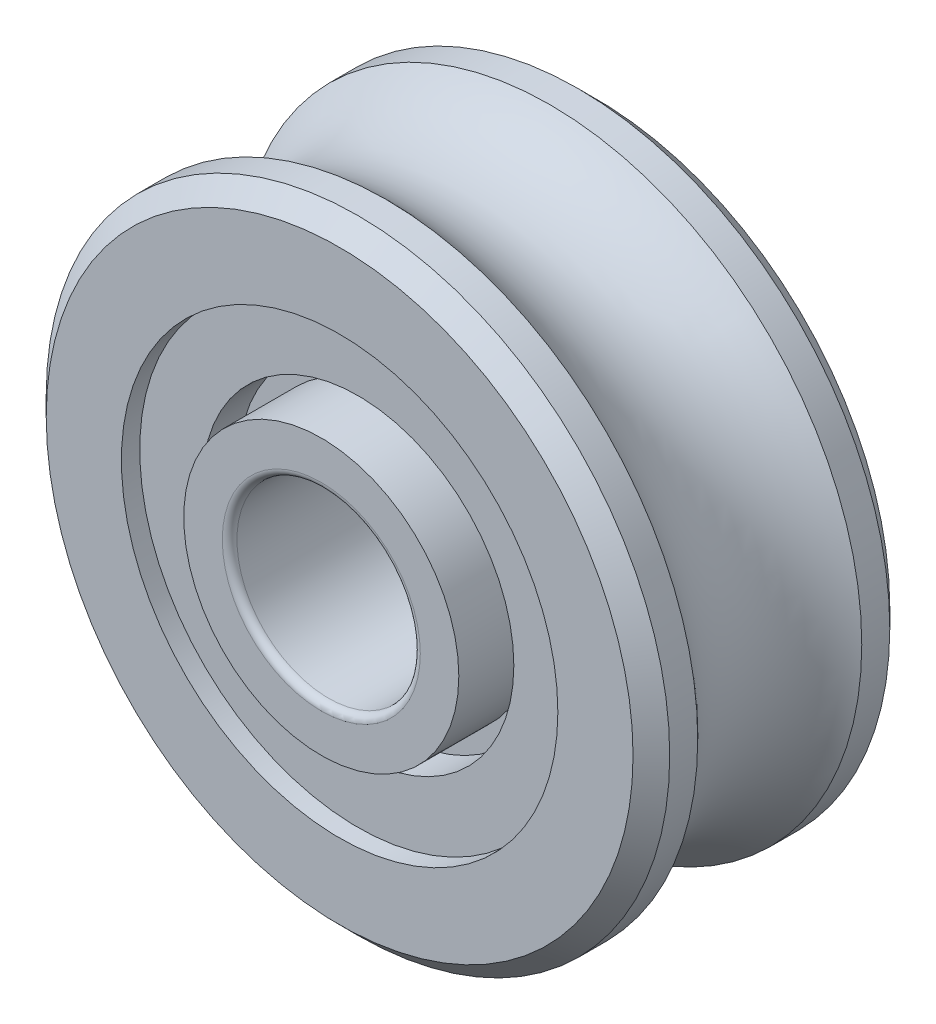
ISO-10303-21;
HEADER;
FILE_DESCRIPTION(('STEP AP214'),'2;1');
FILE_NAME('part.step','',(''),(''),'','','');
FILE_SCHEMA(('AUTOMOTIVE_DESIGN { 1 0 10303 214 1 1 1 1 }'));
ENDSEC;
DATA;
#1=APPLICATION_CONTEXT('core data for automotive mechanical design processes');
#2=APPLICATION_PROTOCOL_DEFINITION('international standard','automotive_design',2000,#1);
#3=PRODUCT_CONTEXT('',#1,'mechanical');
#4=PRODUCT('Part','Part','',(#3));
#5=PRODUCT_RELATED_PRODUCT_CATEGORY('part','',(#4));
#6=PRODUCT_DEFINITION_FORMATION('','',#4);
#7=PRODUCT_DEFINITION_CONTEXT('part definition',#1,'design');
#8=PRODUCT_DEFINITION('design','',#6,#7);
#9=PRODUCT_DEFINITION_SHAPE('','',#8);
#10=(LENGTH_UNIT() NAMED_UNIT(*) SI_UNIT(.MILLI.,.METRE.));
#11=(NAMED_UNIT(*) PLANE_ANGLE_UNIT() SI_UNIT($,.RADIAN.));
#12=(NAMED_UNIT(*) SI_UNIT($,.STERADIAN.) SOLID_ANGLE_UNIT());
#13=UNCERTAINTY_MEASURE_WITH_UNIT(LENGTH_MEASURE(1.E-05),#10,'distance_accuracy_value','');
#14=(GEOMETRIC_REPRESENTATION_CONTEXT(3) GLOBAL_UNCERTAINTY_ASSIGNED_CONTEXT((#13)) GLOBAL_UNIT_ASSIGNED_CONTEXT((#10,
#11,#12)) REPRESENTATION_CONTEXT('',''));
#15=CARTESIAN_POINT('',(0.,0.,0.));
#16=DIRECTION('',(0.,0.,1.));
#17=DIRECTION('',(1.,0.,0.));
#18=AXIS2_PLACEMENT_3D('',#15,#16,#17);
#19=CARTESIAN_POINT('',(0.,3.75,2.));
#20=DIRECTION('',(0.,0.,-1.));
#21=DIRECTION('',(-1.,0.,0.));
#22=AXIS2_PLACEMENT_3D('',#19,#20,#21);
#23=PLANE('',#22);
#24=CARTESIAN_POINT('',(0.,0.,2.));
#25=DIRECTION('',(0.,0.,1.));
#26=DIRECTION('',(1.,0.,0.));
#27=AXIS2_PLACEMENT_3D('',#24,#25,#26);
#28=CIRCLE('',#27,4.25);
#29=CARTESIAN_POINT('',(4.25,0.,2.));
#30=VERTEX_POINT('',#29);
#31=EDGE_CURVE('E200',#30,#30,#28,.T.);
#32=ORIENTED_EDGE('',*,*,#31,.T.);
#33=EDGE_LOOP('',(#32));
#34=FACE_BOUND('',#33,.T.);
#35=CARTESIAN_POINT('',(0.,0.,2.));
#36=DIRECTION('',(0.,0.,1.));
#37=DIRECTION('',(1.,0.,0.));
#38=AXIS2_PLACEMENT_3D('',#35,#36,#37);
#39=CIRCLE('',#38,3.75);
#40=CARTESIAN_POINT('',(3.75,0.,2.));
#41=VERTEX_POINT('',#40);
#42=EDGE_CURVE('E197',#41,#41,#39,.T.);
#43=ORIENTED_EDGE('',*,*,#42,.F.);
#44=EDGE_LOOP('',(#43));
#45=FACE_BOUND('',#44,.T.);
#46=ADVANCED_FACE('F14',(#34,#45),#23,.F.);
#47=CARTESIAN_POINT('',(0.,0.,38.6779652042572));
#48=DIRECTION('',(0.,0.,1.));
#49=DIRECTION('',(1.,0.,0.));
#50=AXIS2_PLACEMENT_3D('',#47,#48,#49);
#51=CYLINDRICAL_SURFACE('',#50,3.75);
#52=CARTESIAN_POINT('',(0.,0.,4.));
#53=DIRECTION('',(0.,0.,1.));
#54=DIRECTION('',(1.,0.,0.));
#55=AXIS2_PLACEMENT_3D('',#52,#53,#54);
#56=CIRCLE('',#55,3.75);
#57=CARTESIAN_POINT('',(3.75,0.,4.));
#58=VERTEX_POINT('',#57);
#59=EDGE_CURVE('E203',#58,#58,#56,.F.);
#60=ORIENTED_EDGE('',*,*,#59,.T.);
#61=EDGE_LOOP('',(#60));
#62=FACE_BOUND('',#61,.T.);
#63=ORIENTED_EDGE('',*,*,#42,.T.);
#64=EDGE_LOOP('',(#63));
#65=FACE_BOUND('',#64,.T.);
#66=ADVANCED_FACE('F83',(#62,#65),#51,.T.);
#67=CARTESIAN_POINT('',(0.,0.,38.6779652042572));
#68=DIRECTION('',(0.,0.,1.));
#69=DIRECTION('',(1.,0.,0.));
#70=AXIS2_PLACEMENT_3D('',#67,#68,#69);
#71=CYLINDRICAL_SURFACE('',#70,4.25);
#72=ORIENTED_EDGE('',*,*,#31,.F.);
#73=EDGE_LOOP('',(#72));
#74=FACE_BOUND('',#73,.T.);
#75=CARTESIAN_POINT('',(0.,0.,3.));
#76=DIRECTION('',(0.,0.,1.));
#77=DIRECTION('',(1.,0.,0.));
#78=AXIS2_PLACEMENT_3D('',#75,#76,#77);
#79=CIRCLE('',#78,4.25);
#80=CARTESIAN_POINT('',(4.25,0.,3.));
#81=VERTEX_POINT('',#80);
#82=EDGE_CURVE('E54',#81,#81,#79,.T.);
#83=ORIENTED_EDGE('',*,*,#82,.T.);
#84=EDGE_LOOP('',(#83));
#85=FACE_BOUND('',#84,.T.);
#86=ADVANCED_FACE('F72',(#74,#85),#71,.F.);
#87=CARTESIAN_POINT('',(0.,3.75,4.));
#88=DIRECTION('',(0.,0.,-1.));
#89=DIRECTION('',(-1.,0.,0.));
#90=AXIS2_PLACEMENT_3D('',#87,#88,#89);
#91=PLANE('',#90);
#92=ORIENTED_EDGE('',*,*,#59,.F.);
#93=EDGE_LOOP('',(#92));
#94=FACE_BOUND('',#93,.T.);
#95=CARTESIAN_POINT('',(0.,0.,4.));
#96=DIRECTION('',(0.,0.,1.));
#97=DIRECTION('',(-1.,0.,0.));
#98=AXIS2_PLACEMENT_3D('',#95,#96,#97);
#99=CIRCLE('',#98,2.7);
#100=CARTESIAN_POINT('',(-2.7,0.,4.));
#101=VERTEX_POINT('',#100);
#102=CARTESIAN_POINT('',(2.7,0.,4.));
#103=VERTEX_POINT('',#102);
#104=EDGE_CURVE('E42',#101,#103,#99,.T.);
#105=ORIENTED_EDGE('',*,*,#104,.F.);
#106=CARTESIAN_POINT('',(0.,0.,4.));
#107=DIRECTION('',(0.,0.,1.));
#108=DIRECTION('',(1.,0.,0.));
#109=AXIS2_PLACEMENT_3D('',#106,#107,#108);
#110=CIRCLE('',#109,2.7);
#111=EDGE_CURVE('E44',#103,#101,#110,.T.);
#112=ORIENTED_EDGE('',*,*,#111,.F.);
#113=EDGE_LOOP('',(#105,#112));
#114=FACE_BOUND('',#113,.T.);
#115=ADVANCED_FACE('F53',(#94,#114),#91,.F.);
#116=CARTESIAN_POINT('',(0.,5.95,3.));
#117=DIRECTION('',(0.,0.,-1.));
#118=DIRECTION('',(-1.,0.,0.));
#119=AXIS2_PLACEMENT_3D('',#116,#117,#118);
#120=PLANE('',#119);
#121=CARTESIAN_POINT('',(0.,0.,3.));
#122=DIRECTION('',(0.,0.,1.));
#123=DIRECTION('',(1.,0.,0.));
#124=AXIS2_PLACEMENT_3D('',#121,#122,#123);
#125=CIRCLE('',#124,5.95);
#126=CARTESIAN_POINT('',(5.95,0.,3.));
#127=VERTEX_POINT('',#126);
#128=EDGE_CURVE('E49',#127,#127,#125,.T.);
#129=ORIENTED_EDGE('',*,*,#128,.T.);
#130=EDGE_LOOP('',(#129));
#131=FACE_BOUND('',#130,.T.);
#132=ORIENTED_EDGE('',*,*,#82,.F.);
#133=EDGE_LOOP('',(#132));
#134=FACE_BOUND('',#133,.T.);
#135=ADVANCED_FACE('F71',(#131,#134),#120,.F.);
#136=CARTESIAN_POINT('',(0.,0.,3.8));
#137=DIRECTION('',(0.,0.,1.));
#138=DIRECTION('',(1.,0.,0.));
#139=AXIS2_PLACEMENT_3D('',#136,#137,#138);
#140=TOROIDAL_SURFACE('',#139,2.7,0.2);
#141=CARTESIAN_POINT('',(0.,0.,3.8));
#142=DIRECTION('',(0.,0.,1.));
#143=DIRECTION('',(1.,0.,0.));
#144=AXIS2_PLACEMENT_3D('',#141,#142,#143);
#145=CIRCLE('',#144,2.5);
#146=CARTESIAN_POINT('',(2.5,0.,3.8));
#147=VERTEX_POINT('',#146);
#148=EDGE_CURVE('E209',#147,#147,#145,.F.);
#149=ORIENTED_EDGE('',*,*,#148,.T.);
#150=EDGE_LOOP('',(#149));
#151=FACE_BOUND('',#150,.T.);
#152=ORIENTED_EDGE('',*,*,#111,.T.);
#153=ORIENTED_EDGE('',*,*,#104,.T.);
#154=EDGE_LOOP('',(#152,#153));
#155=FACE_BOUND('',#154,.T.);
#156=ADVANCED_FACE('F46',(#151,#155),#140,.T.);
#157=CARTESIAN_POINT('',(0.,0.,38.6779652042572));
#158=DIRECTION('',(0.,0.,1.));
#159=DIRECTION('',(1.,0.,0.));
#160=AXIS2_PLACEMENT_3D('',#157,#158,#159);
#161=CYLINDRICAL_SURFACE('',#160,5.95);
#162=ORIENTED_EDGE('',*,*,#128,.F.);
#163=EDGE_LOOP('',(#162));
#164=FACE_BOUND('',#163,.T.);
#165=CARTESIAN_POINT('',(0.,0.,3.5));
#166=DIRECTION('',(0.,0.,1.));
#167=DIRECTION('',(1.,0.,0.));
#168=AXIS2_PLACEMENT_3D('',#165,#166,#167);
#169=CIRCLE('',#168,5.95);
#170=CARTESIAN_POINT('',(5.95,0.,3.5));
#171=VERTEX_POINT('',#170);
#172=EDGE_CURVE('E210',#171,#171,#169,.T.);
#173=ORIENTED_EDGE('',*,*,#172,.T.);
#174=EDGE_LOOP('',(#173));
#175=FACE_BOUND('',#174,.T.);
#176=ADVANCED_FACE('F242',(#164,#175),#161,.F.);
#177=CARTESIAN_POINT('',(0.,0.,38.6779652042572));
#178=DIRECTION('',(0.,0.,1.));
#179=DIRECTION('',(1.,0.,0.));
#180=AXIS2_PLACEMENT_3D('',#177,#178,#179);
#181=CYLINDRICAL_SURFACE('',#180,2.5);
#182=CARTESIAN_POINT('',(0.,0.,-3.8));
#183=DIRECTION('',(0.,0.,1.));
#184=DIRECTION('',(1.,0.,0.));
#185=AXIS2_PLACEMENT_3D('',#182,#183,#184);
#186=CIRCLE('',#185,2.5);
#187=CARTESIAN_POINT('',(2.5,0.,-3.8));
#188=VERTEX_POINT('',#187);
#189=EDGE_CURVE('E213',#188,#188,#186,.T.);
#190=ORIENTED_EDGE('',*,*,#189,.F.);
#191=EDGE_LOOP('',(#190));
#192=FACE_BOUND('',#191,.T.);
#193=ORIENTED_EDGE('',*,*,#148,.F.);
#194=EDGE_LOOP('',(#193));
#195=FACE_BOUND('',#194,.T.);
#196=ADVANCED_FACE('F246',(#192,#195),#181,.F.);
#197=CARTESIAN_POINT('',(0.,8.,3.5));
#198=DIRECTION('',(0.,0.,-1.));
#199=DIRECTION('',(-1.,0.,0.));
#200=AXIS2_PLACEMENT_3D('',#197,#198,#199);
#201=PLANE('',#200);
#202=CARTESIAN_POINT('',(0.,0.,3.5));
#203=DIRECTION('',(0.,0.,-1.));
#204=DIRECTION('',(-1.,0.,0.));
#205=AXIS2_PLACEMENT_3D('',#202,#203,#204);
#206=CIRCLE('',#205,8.);
#207=CARTESIAN_POINT('',(-8.,0.,3.5));
#208=VERTEX_POINT('',#207);
#209=EDGE_CURVE('E214',#208,#208,#206,.T.);
#210=ORIENTED_EDGE('',*,*,#209,.F.);
#211=EDGE_LOOP('',(#210));
#212=FACE_BOUND('',#211,.T.);
#213=ORIENTED_EDGE('',*,*,#172,.F.);
#214=EDGE_LOOP('',(#213));
#215=FACE_BOUND('',#214,.T.);
#216=ADVANCED_FACE('F180',(#212,#215),#201,.F.);
#217=CARTESIAN_POINT('',(0.,0.,-3.8));
#218=DIRECTION('',(0.,0.,1.));
#219=DIRECTION('',(1.,0.,0.));
#220=AXIS2_PLACEMENT_3D('',#217,#218,#219);
#221=TOROIDAL_SURFACE('',#220,2.7,0.2);
#222=CARTESIAN_POINT('',(0.,0.,-4.));
#223=DIRECTION('',(0.,0.,-1.));
#224=DIRECTION('',(1.,0.,0.));
#225=AXIS2_PLACEMENT_3D('',#222,#223,#224);
#226=CIRCLE('',#225,2.7);
#227=CARTESIAN_POINT('',(2.7,0.,-4.));
#228=VERTEX_POINT('',#227);
#229=CARTESIAN_POINT('',(-2.7,0.,-4.));
#230=VERTEX_POINT('',#229);
#231=EDGE_CURVE('E143',#228,#230,#226,.T.);
#232=ORIENTED_EDGE('',*,*,#231,.T.);
#233=CARTESIAN_POINT('',(0.,0.,-4.));
#234=DIRECTION('',(0.,0.,-1.));
#235=DIRECTION('',(-1.,0.,0.));
#236=AXIS2_PLACEMENT_3D('',#233,#234,#235);
#237=CIRCLE('',#236,2.7);
#238=EDGE_CURVE('E33',#230,#228,#237,.T.);
#239=ORIENTED_EDGE('',*,*,#238,.T.);
#240=EDGE_LOOP('',(#232,#239));
#241=FACE_BOUND('',#240,.T.);
#242=ORIENTED_EDGE('',*,*,#189,.T.);
#243=EDGE_LOOP('',(#242));
#244=FACE_BOUND('',#243,.T.);
#245=ADVANCED_FACE('F176',(#241,#244),#221,.T.);
#246=CARTESIAN_POINT('',(0.,0.,3.));
#247=DIRECTION('',(0.,0.,-1.));
#248=DIRECTION('',(-1.,0.,0.));
#249=AXIS2_PLACEMENT_3D('',#246,#247,#248);
#250=CONICAL_SURFACE('',#249,8.5,0.785398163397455);
#251=CARTESIAN_POINT('',(0.,0.,3.));
#252=DIRECTION('',(0.,0.,1.));
#253=DIRECTION('',(1.,0.,0.));
#254=AXIS2_PLACEMENT_3D('',#251,#252,#253);
#255=CIRCLE('',#254,8.5);
#256=CARTESIAN_POINT('',(8.5,0.,3.));
#257=VERTEX_POINT('',#256);
#258=EDGE_CURVE('E165',#257,#257,#255,.F.);
#259=ORIENTED_EDGE('',*,*,#258,.F.);
#260=EDGE_LOOP('',(#259));
#261=FACE_BOUND('',#260,.T.);
#262=ORIENTED_EDGE('',*,*,#209,.T.);
#263=EDGE_LOOP('',(#262));
#264=FACE_BOUND('',#263,.T.);
#265=ADVANCED_FACE('F159',(#261,#264),#250,.T.);
#266=CARTESIAN_POINT('',(0.,3.75,-4.));
#267=DIRECTION('',(0.,0.,1.));
#268=DIRECTION('',(1.,0.,0.));
#269=AXIS2_PLACEMENT_3D('',#266,#267,#268);
#270=PLANE('',#269);
#271=ORIENTED_EDGE('',*,*,#231,.F.);
#272=ORIENTED_EDGE('',*,*,#238,.F.);
#273=EDGE_LOOP('',(#271,#272));
#274=FACE_BOUND('',#273,.T.);
#275=CARTESIAN_POINT('',(0.,0.,-4.));
#276=DIRECTION('',(0.,0.,1.));
#277=DIRECTION('',(1.,0.,0.));
#278=AXIS2_PLACEMENT_3D('',#275,#276,#277);
#279=CIRCLE('',#278,3.75);
#280=CARTESIAN_POINT('',(3.75,0.,-4.));
#281=VERTEX_POINT('',#280);
#282=EDGE_CURVE('E141',#281,#281,#279,.T.);
#283=ORIENTED_EDGE('',*,*,#282,.F.);
#284=EDGE_LOOP('',(#283));
#285=FACE_BOUND('',#284,.T.);
#286=ADVANCED_FACE('F148',(#274,#285),#270,.F.);
#287=CARTESIAN_POINT('',(0.,0.,38.6779652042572));
#288=DIRECTION('',(0.,0.,1.));
#289=DIRECTION('',(1.,0.,0.));
#290=AXIS2_PLACEMENT_3D('',#287,#288,#289);
#291=CYLINDRICAL_SURFACE('',#290,8.5);
#292=ORIENTED_EDGE('',*,*,#258,.T.);
#293=EDGE_LOOP('',(#292));
#294=FACE_BOUND('',#293,.T.);
#295=CARTESIAN_POINT('',(0.,0.,2.23606797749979));
#296=DIRECTION('',(0.,0.,1.));
#297=DIRECTION('',(1.,0.,0.));
#298=AXIS2_PLACEMENT_3D('',#295,#296,#297);
#299=CIRCLE('',#298,8.5);
#300=CARTESIAN_POINT('',(8.5,0.,2.23606797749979));
#301=VERTEX_POINT('',#300);
#302=EDGE_CURVE('E137',#301,#301,#299,.T.);
#303=ORIENTED_EDGE('',*,*,#302,.T.);
#304=EDGE_LOOP('',(#303));
#305=FACE_BOUND('',#304,.T.);
#306=ADVANCED_FACE('F158',(#294,#305),#291,.T.);
#307=CARTESIAN_POINT('',(0.,0.,38.6779652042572));
#308=DIRECTION('',(0.,0.,1.));
#309=DIRECTION('',(1.,0.,0.));
#310=AXIS2_PLACEMENT_3D('',#307,#308,#309);
#311=CYLINDRICAL_SURFACE('',#310,3.75);
#312=CARTESIAN_POINT('',(0.,0.,-2.));
#313=DIRECTION('',(0.,0.,1.));
#314=DIRECTION('',(1.,0.,0.));
#315=AXIS2_PLACEMENT_3D('',#312,#313,#314);
#316=CIRCLE('',#315,3.75);
#317=CARTESIAN_POINT('',(3.75,0.,-2.));
#318=VERTEX_POINT('',#317);
#319=EDGE_CURVE('E140',#318,#318,#316,.F.);
#320=ORIENTED_EDGE('',*,*,#319,.T.);
#321=EDGE_LOOP('',(#320));
#322=FACE_BOUND('',#321,.T.);
#323=ORIENTED_EDGE('',*,*,#282,.T.);
#324=EDGE_LOOP('',(#323));
#325=FACE_BOUND('',#324,.T.);
#326=ADVANCED_FACE('F278',(#322,#325),#311,.T.);
#327=CARTESIAN_POINT('',(0.,3.75,-2.));
#328=DIRECTION('',(0.,0.,1.));
#329=DIRECTION('',(1.,0.,0.));
#330=AXIS2_PLACEMENT_3D('',#327,#328,#329);
#331=PLANE('',#330);
#332=ORIENTED_EDGE('',*,*,#319,.F.);
#333=EDGE_LOOP('',(#332));
#334=FACE_BOUND('',#333,.T.);
#335=CARTESIAN_POINT('',(0.,0.,-2.));
#336=DIRECTION('',(0.,0.,1.));
#337=DIRECTION('',(1.,0.,0.));
#338=AXIS2_PLACEMENT_3D('',#335,#336,#337);
#339=CIRCLE('',#338,4.25);
#340=CARTESIAN_POINT('',(4.25,0.,-2.));
#341=VERTEX_POINT('',#340);
#342=EDGE_CURVE('E221',#341,#341,#339,.F.);
#343=ORIENTED_EDGE('',*,*,#342,.T.);
#344=EDGE_LOOP('',(#343));
#345=FACE_BOUND('',#344,.T.);
#346=ADVANCED_FACE('F129',(#334,#345),#331,.F.);
#347=CARTESIAN_POINT('',(0.,0.,0.));
#348=DIRECTION('',(0.,0.,1.));
#349=DIRECTION('',(1.,0.,0.));
#350=AXIS2_PLACEMENT_3D('',#347,#348,#349);
#351=TOROIDAL_SURFACE('',#350,10.5,3.);
#352=ORIENTED_EDGE('',*,*,#302,.F.);
#353=EDGE_LOOP('',(#352));
#354=FACE_BOUND('',#353,.T.);
#355=CARTESIAN_POINT('',(0.,0.,-2.2360679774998));
#356=DIRECTION('',(0.,0.,1.));
#357=DIRECTION('',(1.,0.,0.));
#358=AXIS2_PLACEMENT_3D('',#355,#356,#357);
#359=CIRCLE('',#358,8.5);
#360=CARTESIAN_POINT('',(8.5,0.,-2.2360679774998));
#361=VERTEX_POINT('',#360);
#362=EDGE_CURVE('E135',#361,#361,#359,.F.);
#363=ORIENTED_EDGE('',*,*,#362,.F.);
#364=EDGE_LOOP('',(#363));
#365=FACE_BOUND('',#364,.T.);
#366=ADVANCED_FACE('F124',(#354,#365),#351,.F.);
#367=CARTESIAN_POINT('',(0.,0.,38.6779652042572));
#368=DIRECTION('',(0.,0.,1.));
#369=DIRECTION('',(1.,0.,0.));
#370=AXIS2_PLACEMENT_3D('',#367,#368,#369);
#371=CYLINDRICAL_SURFACE('',#370,4.25);
#372=CARTESIAN_POINT('',(0.,0.,-3.));
#373=DIRECTION('',(0.,0.,1.));
#374=DIRECTION('',(1.,0.,0.));
#375=AXIS2_PLACEMENT_3D('',#372,#373,#374);
#376=CIRCLE('',#375,4.25);
#377=CARTESIAN_POINT('',(4.25,0.,-3.));
#378=VERTEX_POINT('',#377);
#379=EDGE_CURVE('E224',#378,#378,#376,.F.);
#380=ORIENTED_EDGE('',*,*,#379,.T.);
#381=EDGE_LOOP('',(#380));
#382=FACE_BOUND('',#381,.T.);
#383=ORIENTED_EDGE('',*,*,#342,.F.);
#384=EDGE_LOOP('',(#383));
#385=FACE_BOUND('',#384,.T.);
#386=ADVANCED_FACE('F120',(#382,#385),#371,.F.);
#387=CARTESIAN_POINT('',(0.,0.,38.6779652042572));
#388=DIRECTION('',(0.,0.,1.));
#389=DIRECTION('',(1.,0.,0.));
#390=AXIS2_PLACEMENT_3D('',#387,#388,#389);
#391=CYLINDRICAL_SURFACE('',#390,8.5);
#392=ORIENTED_EDGE('',*,*,#362,.T.);
#393=EDGE_LOOP('',(#392));
#394=FACE_BOUND('',#393,.T.);
#395=CARTESIAN_POINT('',(0.,0.,-3.));
#396=DIRECTION('',(0.,0.,1.));
#397=DIRECTION('',(1.,0.,0.));
#398=AXIS2_PLACEMENT_3D('',#395,#396,#397);
#399=CIRCLE('',#398,8.5);
#400=CARTESIAN_POINT('',(8.5,0.,-3.));
#401=VERTEX_POINT('',#400);
#402=EDGE_CURVE('E227',#401,#401,#399,.F.);
#403=ORIENTED_EDGE('',*,*,#402,.F.);
#404=EDGE_LOOP('',(#403));
#405=FACE_BOUND('',#404,.T.);
#406=ADVANCED_FACE('F116',(#394,#405),#391,.T.);
#407=CARTESIAN_POINT('',(0.,5.95,-3.));
#408=DIRECTION('',(0.,0.,1.));
#409=DIRECTION('',(1.,0.,0.));
#410=AXIS2_PLACEMENT_3D('',#407,#408,#409);
#411=PLANE('',#410);
#412=ORIENTED_EDGE('',*,*,#379,.F.);
#413=EDGE_LOOP('',(#412));
#414=FACE_BOUND('',#413,.T.);
#415=CARTESIAN_POINT('',(0.,0.,-3.));
#416=DIRECTION('',(0.,0.,1.));
#417=DIRECTION('',(1.,0.,0.));
#418=AXIS2_PLACEMENT_3D('',#415,#416,#417);
#419=CIRCLE('',#418,5.95);
#420=CARTESIAN_POINT('',(5.95,0.,-3.));
#421=VERTEX_POINT('',#420);
#422=EDGE_CURVE('E228',#421,#421,#419,.F.);
#423=ORIENTED_EDGE('',*,*,#422,.T.);
#424=EDGE_LOOP('',(#423));
#425=FACE_BOUND('',#424,.T.);
#426=ADVANCED_FACE('F112',(#414,#425),#411,.F.);
#427=CARTESIAN_POINT('',(0.,0.,-3.));
#428=DIRECTION('',(0.,0.,1.));
#429=DIRECTION('',(1.,0.,0.));
#430=AXIS2_PLACEMENT_3D('',#427,#428,#429);
#431=CONICAL_SURFACE('',#430,8.5,0.785398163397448);
#432=ORIENTED_EDGE('',*,*,#402,.T.);
#433=EDGE_LOOP('',(#432));
#434=FACE_BOUND('',#433,.T.);
#435=CARTESIAN_POINT('',(0.,0.,-3.5));
#436=DIRECTION('',(0.,0.,1.));
#437=DIRECTION('',(1.,0.,0.));
#438=AXIS2_PLACEMENT_3D('',#435,#436,#437);
#439=CIRCLE('',#438,8.);
#440=CARTESIAN_POINT('',(8.,0.,-3.5));
#441=VERTEX_POINT('',#440);
#442=EDGE_CURVE('E25',#441,#441,#439,.T.);
#443=ORIENTED_EDGE('',*,*,#442,.T.);
#444=EDGE_LOOP('',(#443));
#445=FACE_BOUND('',#444,.T.);
#446=ADVANCED_FACE('F104',(#434,#445),#431,.T.);
#447=CARTESIAN_POINT('',(0.,0.,38.6779652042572));
#448=DIRECTION('',(0.,0.,1.));
#449=DIRECTION('',(1.,0.,0.));
#450=AXIS2_PLACEMENT_3D('',#447,#448,#449);
#451=CYLINDRICAL_SURFACE('',#450,5.95);
#452=CARTESIAN_POINT('',(0.,0.,-3.5));
#453=DIRECTION('',(0.,0.,1.));
#454=DIRECTION('',(1.,0.,0.));
#455=AXIS2_PLACEMENT_3D('',#452,#453,#454);
#456=CIRCLE('',#455,5.95);
#457=CARTESIAN_POINT('',(5.95,0.,-3.5));
#458=VERTEX_POINT('',#457);
#459=EDGE_CURVE('E9',#458,#458,#456,.F.);
#460=ORIENTED_EDGE('',*,*,#459,.T.);
#461=EDGE_LOOP('',(#460));
#462=FACE_BOUND('',#461,.T.);
#463=ORIENTED_EDGE('',*,*,#422,.F.);
#464=EDGE_LOOP('',(#463));
#465=FACE_BOUND('',#464,.T.);
#466=ADVANCED_FACE('F97',(#462,#465),#451,.F.);
#467=CARTESIAN_POINT('',(0.,8.,-3.5));
#468=DIRECTION('',(0.,0.,1.));
#469=DIRECTION('',(1.,0.,0.));
#470=AXIS2_PLACEMENT_3D('',#467,#468,#469);
#471=PLANE('',#470);
#472=ORIENTED_EDGE('',*,*,#459,.F.);
#473=EDGE_LOOP('',(#472));
#474=FACE_BOUND('',#473,.T.);
#475=ORIENTED_EDGE('',*,*,#442,.F.);
#476=EDGE_LOOP('',(#475));
#477=FACE_BOUND('',#476,.T.);
#478=ADVANCED_FACE('F95',(#474,#477),#471,.F.);
#479=CLOSED_SHELL('',(#46,#66,#86,#115,#135,#156,#176,#196,#216,#245,#265,#286,#306,#326,#346,
#366,#386,#406,#426,#446,#466,#478));
#480=MANIFOLD_SOLID_BREP('B1',#479);
#481=ADVANCED_BREP_SHAPE_REPRESENTATION('',(#18,#480),#14);
#482=SHAPE_DEFINITION_REPRESENTATION(#9,#481);
ENDSEC;
END-ISO-10303-21;
